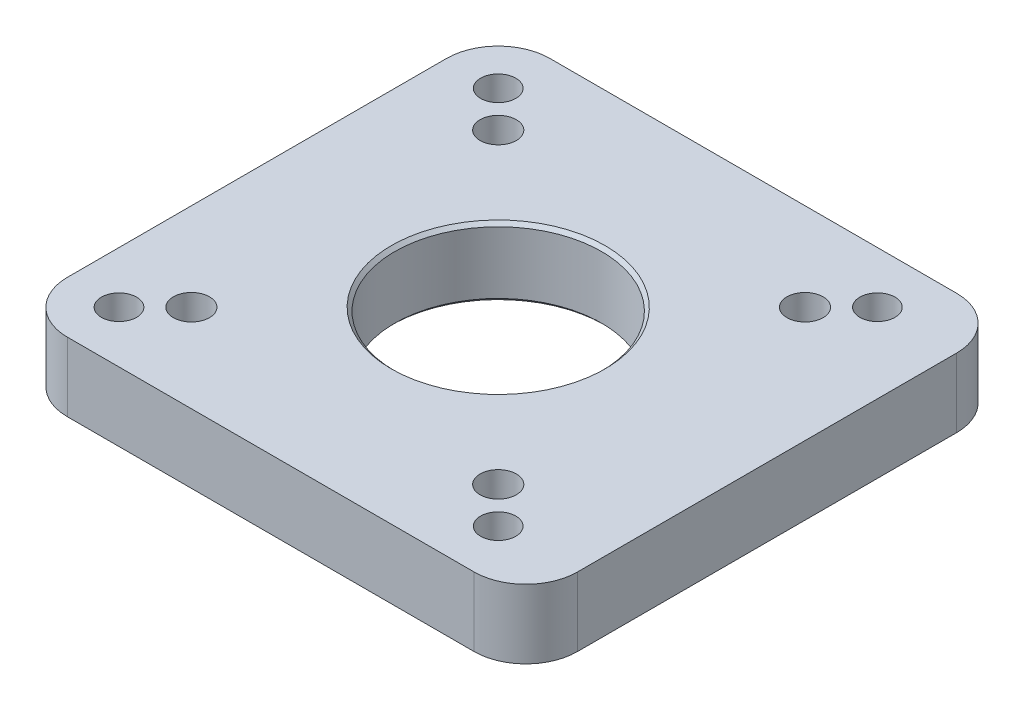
ISO-10303-21;
HEADER;
FILE_DESCRIPTION(('STEP AP214'),'2;1');
FILE_NAME('part.step','',(''),(''),'','','');
FILE_SCHEMA(('AUTOMOTIVE_DESIGN { 1 0 10303 214 1 1 1 1 }'));
ENDSEC;
DATA;
#1=APPLICATION_CONTEXT('core data for automotive mechanical design processes');
#2=APPLICATION_PROTOCOL_DEFINITION('international standard','automotive_design',2000,#1);
#3=PRODUCT_CONTEXT('',#1,'mechanical');
#4=PRODUCT('Part','Part','',(#3));
#5=PRODUCT_RELATED_PRODUCT_CATEGORY('part','',(#4));
#6=PRODUCT_DEFINITION_FORMATION('','',#4);
#7=PRODUCT_DEFINITION_CONTEXT('part definition',#1,'design');
#8=PRODUCT_DEFINITION('design','',#6,#7);
#9=PRODUCT_DEFINITION_SHAPE('','',#8);
#10=(LENGTH_UNIT() NAMED_UNIT(*) SI_UNIT(.MILLI.,.METRE.));
#11=(NAMED_UNIT(*) PLANE_ANGLE_UNIT() SI_UNIT($,.RADIAN.));
#12=(NAMED_UNIT(*) SI_UNIT($,.STERADIAN.) SOLID_ANGLE_UNIT());
#13=UNCERTAINTY_MEASURE_WITH_UNIT(LENGTH_MEASURE(1.E-05),#10,'distance_accuracy_value','');
#14=(GEOMETRIC_REPRESENTATION_CONTEXT(3) GLOBAL_UNCERTAINTY_ASSIGNED_CONTEXT((#13)) GLOBAL_UNIT_ASSIGNED_CONTEXT((#10,
#11,#12)) REPRESENTATION_CONTEXT('',''));
#15=CARTESIAN_POINT('',(0.,0.,0.));
#16=DIRECTION('',(0.,0.,1.));
#17=DIRECTION('',(1.,0.,0.));
#18=AXIS2_PLACEMENT_3D('',#15,#16,#17);
#19=CARTESIAN_POINT('',(-70.,20.,70.));
#20=DIRECTION('',(0.,1.,0.));
#21=DIRECTION('',(0.,0.,1.));
#22=AXIS2_PLACEMENT_3D('',#19,#20,#21);
#23=PLANE('',#22);
#24=CARTESIAN_POINT('',(0.,20.,0.));
#25=DIRECTION('',(0.,1.,0.));
#26=DIRECTION('',(0.,0.,1.));
#27=AXIS2_PLACEMENT_3D('',#24,#25,#26);
#28=CIRCLE('',#27,31.);
#29=CARTESIAN_POINT('',(0.,20.,31.));
#30=VERTEX_POINT('',#29);
#31=EDGE_CURVE('E356',#30,#30,#28,.F.);
#32=ORIENTED_EDGE('',*,*,#31,.T.);
#33=EDGE_LOOP('',(#32));
#34=FACE_BOUND('',#33,.T.);
#35=CARTESIAN_POINT('',(-55.,20.,55.));
#36=DIRECTION('',(0.,1.,0.));
#37=DIRECTION('',(0.,0.,1.));
#38=AXIS2_PLACEMENT_3D('',#35,#36,#37);
#39=CIRCLE('',#38,5.09999999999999);
#40=CARTESIAN_POINT('',(-55.,20.,60.1));
#41=VERTEX_POINT('',#40);
#42=EDGE_CURVE('E491',#41,#41,#39,.T.);
#43=ORIENTED_EDGE('',*,*,#42,.F.);
#44=EDGE_LOOP('',(#43));
#45=FACE_BOUND('',#44,.T.);
#46=CARTESIAN_POINT('',(55.,20.,55.));
#47=DIRECTION('',(0.,1.,0.));
#48=DIRECTION('',(0.,0.,1.));
#49=AXIS2_PLACEMENT_3D('',#46,#47,#48);
#50=CIRCLE('',#49,5.09999999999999);
#51=CARTESIAN_POINT('',(55.,20.,60.1));
#52=VERTEX_POINT('',#51);
#53=EDGE_CURVE('E487',#52,#52,#50,.T.);
#54=ORIENTED_EDGE('',*,*,#53,.F.);
#55=EDGE_LOOP('',(#54));
#56=FACE_BOUND('',#55,.T.);
#57=CARTESIAN_POINT('',(55.,20.,-55.));
#58=DIRECTION('',(0.,1.,0.));
#59=DIRECTION('',(0.,0.,1.));
#60=AXIS2_PLACEMENT_3D('',#57,#58,#59);
#61=CIRCLE('',#60,5.09999999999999);
#62=CARTESIAN_POINT('',(55.,20.,-49.9));
#63=VERTEX_POINT('',#62);
#64=EDGE_CURVE('E483',#63,#63,#61,.T.);
#65=ORIENTED_EDGE('',*,*,#64,.F.);
#66=EDGE_LOOP('',(#65));
#67=FACE_BOUND('',#66,.T.);
#68=CARTESIAN_POINT('',(-55.,20.,-55.));
#69=DIRECTION('',(0.,1.,0.));
#70=DIRECTION('',(0.,0.,1.));
#71=AXIS2_PLACEMENT_3D('',#68,#69,#70);
#72=CIRCLE('',#71,5.09999999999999);
#73=CARTESIAN_POINT('',(-55.,20.,-49.9));
#74=VERTEX_POINT('',#73);
#75=EDGE_CURVE('E478',#74,#74,#72,.T.);
#76=ORIENTED_EDGE('',*,*,#75,.F.);
#77=EDGE_LOOP('',(#76));
#78=FACE_BOUND('',#77,.T.);
#79=CARTESIAN_POINT('',(-44.5,20.,44.5));
#80=DIRECTION('',(0.,1.,0.));
#81=DIRECTION('',(0.,0.,1.));
#82=AXIS2_PLACEMENT_3D('',#79,#80,#81);
#83=CIRCLE('',#82,5.24999999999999);
#84=CARTESIAN_POINT('',(-44.5,20.,49.75));
#85=VERTEX_POINT('',#84);
#86=EDGE_CURVE('E473',#85,#85,#83,.T.);
#87=ORIENTED_EDGE('',*,*,#86,.F.);
#88=EDGE_LOOP('',(#87));
#89=FACE_BOUND('',#88,.T.);
#90=CARTESIAN_POINT('',(-44.5,20.,-44.5));
#91=DIRECTION('',(0.,1.,0.));
#92=DIRECTION('',(0.,0.,1.));
#93=AXIS2_PLACEMENT_3D('',#90,#91,#92);
#94=CIRCLE('',#93,5.24999999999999);
#95=CARTESIAN_POINT('',(-44.5,20.,-39.25));
#96=VERTEX_POINT('',#95);
#97=EDGE_CURVE('E468',#96,#96,#94,.T.);
#98=ORIENTED_EDGE('',*,*,#97,.F.);
#99=EDGE_LOOP('',(#98));
#100=FACE_BOUND('',#99,.T.);
#101=CARTESIAN_POINT('',(44.5,20.,-44.5));
#102=DIRECTION('',(0.,1.,0.));
#103=DIRECTION('',(0.,0.,1.));
#104=AXIS2_PLACEMENT_3D('',#101,#102,#103);
#105=CIRCLE('',#104,5.24999999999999);
#106=CARTESIAN_POINT('',(44.5,20.,-39.25));
#107=VERTEX_POINT('',#106);
#108=EDGE_CURVE('E463',#107,#107,#105,.T.);
#109=ORIENTED_EDGE('',*,*,#108,.F.);
#110=EDGE_LOOP('',(#109));
#111=FACE_BOUND('',#110,.T.);
#112=CARTESIAN_POINT('',(44.5,20.,44.5));
#113=DIRECTION('',(0.,1.,0.));
#114=DIRECTION('',(0.,0.,1.));
#115=AXIS2_PLACEMENT_3D('',#112,#113,#114);
#116=CIRCLE('',#115,5.24999999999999);
#117=CARTESIAN_POINT('',(44.5,20.,49.75));
#118=VERTEX_POINT('',#117);
#119=EDGE_CURVE('E447',#118,#118,#116,.T.);
#120=ORIENTED_EDGE('',*,*,#119,.F.);
#121=EDGE_LOOP('',(#120));
#122=FACE_BOUND('',#121,.T.);
#123=DIRECTION('',(0.,0.,1.));
#124=VECTOR('',#123,1.);
#125=CARTESIAN_POINT('',(-70.,20.,-70.));
#126=LINE('',#125,#124);
#127=CARTESIAN_POINT('',(-70.,20.,-55.));
#128=VERTEX_POINT('',#127);
#129=CARTESIAN_POINT('',(-70.,20.,55.));
#130=VERTEX_POINT('',#129);
#131=EDGE_CURVE('E452',#128,#130,#126,.T.);
#132=ORIENTED_EDGE('',*,*,#131,.T.);
#133=CARTESIAN_POINT('',(-55.,20.,55.));
#134=DIRECTION('',(0.,1.,0.));
#135=DIRECTION('',(0.,0.,1.));
#136=AXIS2_PLACEMENT_3D('',#133,#134,#135);
#137=CIRCLE('',#136,15.);
#138=CARTESIAN_POINT('',(-55.,20.,70.));
#139=VERTEX_POINT('',#138);
#140=EDGE_CURVE('E508',#130,#139,#137,.T.);
#141=ORIENTED_EDGE('',*,*,#140,.T.);
#142=DIRECTION('',(1.,0.,0.));
#143=VECTOR('',#142,1.);
#144=CARTESIAN_POINT('',(-70.,20.,70.));
#145=LINE('',#144,#143);
#146=CARTESIAN_POINT('',(63.,20.,70.));
#147=VERTEX_POINT('',#146);
#148=EDGE_CURVE('E435',#139,#147,#145,.T.);
#149=ORIENTED_EDGE('',*,*,#148,.T.);
#150=CARTESIAN_POINT('',(63.,20.,55.));
#151=DIRECTION('',(0.,1.,0.));
#152=DIRECTION('',(0.,0.,1.));
#153=AXIS2_PLACEMENT_3D('',#150,#151,#152);
#154=CIRCLE('',#153,15.);
#155=CARTESIAN_POINT('',(78.,20.,55.));
#156=VERTEX_POINT('',#155);
#157=EDGE_CURVE('E506',#147,#156,#154,.T.);
#158=ORIENTED_EDGE('',*,*,#157,.T.);
#159=DIRECTION('',(0.,0.,-1.));
#160=VECTOR('',#159,1.);
#161=CARTESIAN_POINT('',(78.,20.,-70.));
#162=LINE('',#161,#160);
#163=CARTESIAN_POINT('',(78.,20.,-55.));
#164=VERTEX_POINT('',#163);
#165=EDGE_CURVE('E456',#156,#164,#162,.T.);
#166=ORIENTED_EDGE('',*,*,#165,.T.);
#167=CARTESIAN_POINT('',(63.,20.,-55.));
#168=DIRECTION('',(0.,1.,0.));
#169=DIRECTION('',(0.,0.,1.));
#170=AXIS2_PLACEMENT_3D('',#167,#168,#169);
#171=CIRCLE('',#170,15.);
#172=CARTESIAN_POINT('',(63.,20.,-70.));
#173=VERTEX_POINT('',#172);
#174=EDGE_CURVE('E370',#164,#173,#171,.T.);
#175=ORIENTED_EDGE('',*,*,#174,.T.);
#176=DIRECTION('',(-1.,0.,0.));
#177=VECTOR('',#176,1.);
#178=CARTESIAN_POINT('',(-70.,20.,-70.));
#179=LINE('',#178,#177);
#180=CARTESIAN_POINT('',(-55.,20.,-70.));
#181=VERTEX_POINT('',#180);
#182=EDGE_CURVE('E458',#173,#181,#179,.T.);
#183=ORIENTED_EDGE('',*,*,#182,.T.);
#184=CARTESIAN_POINT('',(-55.,20.,-55.));
#185=DIRECTION('',(0.,1.,0.));
#186=DIRECTION('',(0.,0.,1.));
#187=AXIS2_PLACEMENT_3D('',#184,#185,#186);
#188=CIRCLE('',#187,15.);
#189=EDGE_CURVE('E503',#181,#128,#188,.T.);
#190=ORIENTED_EDGE('',*,*,#189,.T.);
#191=EDGE_LOOP('',(#132,#141,#149,#158,#166,#175,#183,#190));
#192=FACE_BOUND('',#191,.T.);
#193=ADVANCED_FACE('F348',(#34,#45,#56,#67,#78,#89,#100,#111,#122,#192),#23,.T.);
#194=CARTESIAN_POINT('',(-70.,0.,70.));
#195=DIRECTION('',(0.,1.,0.));
#196=DIRECTION('',(0.,0.,1.));
#197=AXIS2_PLACEMENT_3D('',#194,#195,#196);
#198=PLANE('',#197);
#199=CARTESIAN_POINT('',(0.,0.,0.));
#200=DIRECTION('',(0.,1.,0.));
#201=DIRECTION('',(0.,0.,1.));
#202=AXIS2_PLACEMENT_3D('',#199,#200,#201);
#203=CIRCLE('',#202,31.);
#204=CARTESIAN_POINT('',(0.,0.,31.));
#205=VERTEX_POINT('',#204);
#206=EDGE_CURVE('E11',#205,#205,#203,.T.);
#207=ORIENTED_EDGE('',*,*,#206,.T.);
#208=EDGE_LOOP('',(#207));
#209=FACE_BOUND('',#208,.T.);
#210=CARTESIAN_POINT('',(-55.,0.,55.));
#211=DIRECTION('',(0.,-1.,0.));
#212=DIRECTION('',(0.,0.,-1.));
#213=AXIS2_PLACEMENT_3D('',#210,#211,#212);
#214=CIRCLE('',#213,5.09999999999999);
#215=CARTESIAN_POINT('',(-55.,0.,49.9));
#216=VERTEX_POINT('',#215);
#217=EDGE_CURVE('E494',#216,#216,#214,.T.);
#218=ORIENTED_EDGE('',*,*,#217,.F.);
#219=EDGE_LOOP('',(#218));
#220=FACE_BOUND('',#219,.T.);
#221=CARTESIAN_POINT('',(55.,0.,55.));
#222=DIRECTION('',(0.,-1.,0.));
#223=DIRECTION('',(0.,0.,-1.));
#224=AXIS2_PLACEMENT_3D('',#221,#222,#223);
#225=CIRCLE('',#224,5.09999999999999);
#226=CARTESIAN_POINT('',(55.,0.,49.9));
#227=VERTEX_POINT('',#226);
#228=EDGE_CURVE('E490',#227,#227,#225,.T.);
#229=ORIENTED_EDGE('',*,*,#228,.F.);
#230=EDGE_LOOP('',(#229));
#231=FACE_BOUND('',#230,.T.);
#232=CARTESIAN_POINT('',(55.,0.,-55.));
#233=DIRECTION('',(0.,-1.,0.));
#234=DIRECTION('',(0.,0.,-1.));
#235=AXIS2_PLACEMENT_3D('',#232,#233,#234);
#236=CIRCLE('',#235,5.09999999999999);
#237=CARTESIAN_POINT('',(55.,0.,-60.1));
#238=VERTEX_POINT('',#237);
#239=EDGE_CURVE('E486',#238,#238,#236,.T.);
#240=ORIENTED_EDGE('',*,*,#239,.F.);
#241=EDGE_LOOP('',(#240));
#242=FACE_BOUND('',#241,.T.);
#243=CARTESIAN_POINT('',(-55.,0.,-55.));
#244=DIRECTION('',(0.,-1.,0.));
#245=DIRECTION('',(0.,0.,-1.));
#246=AXIS2_PLACEMENT_3D('',#243,#244,#245);
#247=CIRCLE('',#246,5.09999999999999);
#248=CARTESIAN_POINT('',(-55.,0.,-60.1));
#249=VERTEX_POINT('',#248);
#250=EDGE_CURVE('E482',#249,#249,#247,.T.);
#251=ORIENTED_EDGE('',*,*,#250,.F.);
#252=EDGE_LOOP('',(#251));
#253=FACE_BOUND('',#252,.T.);
#254=CARTESIAN_POINT('',(-44.5,0.,44.5));
#255=DIRECTION('',(0.,-1.,0.));
#256=DIRECTION('',(0.,0.,-1.));
#257=AXIS2_PLACEMENT_3D('',#254,#255,#256);
#258=CIRCLE('',#257,9.);
#259=CARTESIAN_POINT('',(-44.5,0.,35.5));
#260=VERTEX_POINT('',#259);
#261=EDGE_CURVE('E477',#260,#260,#258,.T.);
#262=ORIENTED_EDGE('',*,*,#261,.F.);
#263=EDGE_LOOP('',(#262));
#264=FACE_BOUND('',#263,.T.);
#265=CARTESIAN_POINT('',(-44.5,0.,-44.5));
#266=DIRECTION('',(0.,-1.,0.));
#267=DIRECTION('',(0.,0.,-1.));
#268=AXIS2_PLACEMENT_3D('',#265,#266,#267);
#269=CIRCLE('',#268,9.);
#270=CARTESIAN_POINT('',(-44.5,0.,-53.5));
#271=VERTEX_POINT('',#270);
#272=EDGE_CURVE('E472',#271,#271,#269,.T.);
#273=ORIENTED_EDGE('',*,*,#272,.F.);
#274=EDGE_LOOP('',(#273));
#275=FACE_BOUND('',#274,.T.);
#276=CARTESIAN_POINT('',(44.5,0.,-44.5));
#277=DIRECTION('',(0.,-1.,0.));
#278=DIRECTION('',(0.,0.,-1.));
#279=AXIS2_PLACEMENT_3D('',#276,#277,#278);
#280=CIRCLE('',#279,9.);
#281=CARTESIAN_POINT('',(44.5,0.,-53.5));
#282=VERTEX_POINT('',#281);
#283=EDGE_CURVE('E467',#282,#282,#280,.T.);
#284=ORIENTED_EDGE('',*,*,#283,.F.);
#285=EDGE_LOOP('',(#284));
#286=FACE_BOUND('',#285,.T.);
#287=CARTESIAN_POINT('',(44.5,0.,44.5));
#288=DIRECTION('',(0.,-1.,0.));
#289=DIRECTION('',(0.,0.,-1.));
#290=AXIS2_PLACEMENT_3D('',#287,#288,#289);
#291=CIRCLE('',#290,9.);
#292=CARTESIAN_POINT('',(44.5,0.,35.5));
#293=VERTEX_POINT('',#292);
#294=EDGE_CURVE('E462',#293,#293,#291,.T.);
#295=ORIENTED_EDGE('',*,*,#294,.F.);
#296=EDGE_LOOP('',(#295));
#297=FACE_BOUND('',#296,.T.);
#298=DIRECTION('',(1.,0.,0.));
#299=VECTOR('',#298,1.);
#300=CARTESIAN_POINT('',(-70.,0.,70.));
#301=LINE('',#300,#299);
#302=CARTESIAN_POINT('',(-55.,0.,70.));
#303=VERTEX_POINT('',#302);
#304=CARTESIAN_POINT('',(63.,0.,70.));
#305=VERTEX_POINT('',#304);
#306=EDGE_CURVE('E432',#303,#305,#301,.T.);
#307=ORIENTED_EDGE('',*,*,#306,.F.);
#308=CARTESIAN_POINT('',(-55.,0.,55.));
#309=DIRECTION('',(0.,1.,0.));
#310=DIRECTION('',(0.,0.,1.));
#311=AXIS2_PLACEMENT_3D('',#308,#309,#310);
#312=CIRCLE('',#311,15.);
#313=CARTESIAN_POINT('',(-70.,0.,55.));
#314=VERTEX_POINT('',#313);
#315=EDGE_CURVE('E415',#303,#314,#312,.F.);
#316=ORIENTED_EDGE('',*,*,#315,.T.);
#317=DIRECTION('',(0.,0.,1.));
#318=VECTOR('',#317,1.);
#319=CARTESIAN_POINT('',(-70.,0.,-70.));
#320=LINE('',#319,#318);
#321=CARTESIAN_POINT('',(-70.,0.,-55.));
#322=VERTEX_POINT('',#321);
#323=EDGE_CURVE('E442',#322,#314,#320,.T.);
#324=ORIENTED_EDGE('',*,*,#323,.F.);
#325=CARTESIAN_POINT('',(-55.,0.,-55.));
#326=DIRECTION('',(0.,1.,0.));
#327=DIRECTION('',(0.,0.,1.));
#328=AXIS2_PLACEMENT_3D('',#325,#326,#327);
#329=CIRCLE('',#328,15.);
#330=CARTESIAN_POINT('',(-55.,0.,-70.));
#331=VERTEX_POINT('',#330);
#332=EDGE_CURVE('E436',#322,#331,#329,.F.);
#333=ORIENTED_EDGE('',*,*,#332,.T.);
#334=DIRECTION('',(-1.,0.,0.));
#335=VECTOR('',#334,1.);
#336=CARTESIAN_POINT('',(-70.,0.,-70.));
#337=LINE('',#336,#335);
#338=CARTESIAN_POINT('',(63.,0.,-70.));
#339=VERTEX_POINT('',#338);
#340=EDGE_CURVE('E445',#339,#331,#337,.T.);
#341=ORIENTED_EDGE('',*,*,#340,.F.);
#342=CARTESIAN_POINT('',(63.,0.,-55.));
#343=DIRECTION('',(0.,1.,0.));
#344=DIRECTION('',(0.,0.,1.));
#345=AXIS2_PLACEMENT_3D('',#342,#343,#344);
#346=CIRCLE('',#345,15.);
#347=CARTESIAN_POINT('',(78.,0.,-55.));
#348=VERTEX_POINT('',#347);
#349=EDGE_CURVE('E497',#339,#348,#346,.F.);
#350=ORIENTED_EDGE('',*,*,#349,.T.);
#351=DIRECTION('',(0.,0.,-1.));
#352=VECTOR('',#351,1.);
#353=CARTESIAN_POINT('',(78.,0.,-70.));
#354=LINE('',#353,#352);
#355=CARTESIAN_POINT('',(78.,0.,55.));
#356=VERTEX_POINT('',#355);
#357=EDGE_CURVE('E441',#356,#348,#354,.T.);
#358=ORIENTED_EDGE('',*,*,#357,.F.);
#359=CARTESIAN_POINT('',(63.,0.,55.));
#360=DIRECTION('',(0.,1.,0.));
#361=DIRECTION('',(0.,0.,1.));
#362=AXIS2_PLACEMENT_3D('',#359,#360,#361);
#363=CIRCLE('',#362,15.);
#364=EDGE_CURVE('E426',#356,#305,#363,.F.);
#365=ORIENTED_EDGE('',*,*,#364,.T.);
#366=EDGE_LOOP('',(#307,#316,#324,#333,#341,#350,#358,#365));
#367=FACE_BOUND('',#366,.T.);
#368=ADVANCED_FACE('F439',(#209,#220,#231,#242,#253,#264,#275,#286,#297,#367),#198,.F.);
#369=CARTESIAN_POINT('',(-70.,20.,-70.));
#370=DIRECTION('',(1.,0.,0.));
#371=DIRECTION('',(0.,0.,-1.));
#372=AXIS2_PLACEMENT_3D('',#369,#370,#371);
#373=PLANE('',#372);
#374=ORIENTED_EDGE('',*,*,#323,.T.);
#375=DIRECTION('',(0.,-1.,0.));
#376=VECTOR('',#375,1.);
#377=CARTESIAN_POINT('',(-70.,20.,55.));
#378=LINE('',#377,#376);
#379=EDGE_CURVE('E420',#314,#130,#378,.F.);
#380=ORIENTED_EDGE('',*,*,#379,.T.);
#381=ORIENTED_EDGE('',*,*,#131,.F.);
#382=DIRECTION('',(0.,-1.,0.));
#383=VECTOR('',#382,1.);
#384=CARTESIAN_POINT('',(-70.,20.,-55.));
#385=LINE('',#384,#383);
#386=EDGE_CURVE('E425',#128,#322,#385,.T.);
#387=ORIENTED_EDGE('',*,*,#386,.T.);
#388=EDGE_LOOP('',(#374,#380,#381,#387));
#389=FACE_BOUND('',#388,.T.);
#390=ADVANCED_FACE('F350',(#389),#373,.F.);
#391=CARTESIAN_POINT('',(-70.,20.,70.));
#392=DIRECTION('',(0.,0.,-1.));
#393=DIRECTION('',(-1.,0.,0.));
#394=AXIS2_PLACEMENT_3D('',#391,#392,#393);
#395=PLANE('',#394);
#396=ORIENTED_EDGE('',*,*,#148,.F.);
#397=DIRECTION('',(0.,-1.,0.));
#398=VECTOR('',#397,1.);
#399=CARTESIAN_POINT('',(-55.,20.,70.));
#400=LINE('',#399,#398);
#401=EDGE_CURVE('E419',#139,#303,#400,.T.);
#402=ORIENTED_EDGE('',*,*,#401,.T.);
#403=ORIENTED_EDGE('',*,*,#306,.T.);
#404=DIRECTION('',(0.,-1.,0.));
#405=VECTOR('',#404,1.);
#406=CARTESIAN_POINT('',(63.,20.,70.));
#407=LINE('',#406,#405);
#408=EDGE_CURVE('E437',#305,#147,#407,.F.);
#409=ORIENTED_EDGE('',*,*,#408,.T.);
#410=EDGE_LOOP('',(#396,#402,#403,#409));
#411=FACE_BOUND('',#410,.T.);
#412=ADVANCED_FACE('F431',(#411),#395,.F.);
#413=CARTESIAN_POINT('',(78.,20.,-70.));
#414=DIRECTION('',(-1.,0.,0.));
#415=DIRECTION('',(0.,0.,1.));
#416=AXIS2_PLACEMENT_3D('',#413,#414,#415);
#417=PLANE('',#416);
#418=ORIENTED_EDGE('',*,*,#165,.F.);
#419=DIRECTION('',(0.,-1.,0.));
#420=VECTOR('',#419,1.);
#421=CARTESIAN_POINT('',(78.,20.,55.));
#422=LINE('',#421,#420);
#423=EDGE_CURVE('E512',#156,#356,#422,.T.);
#424=ORIENTED_EDGE('',*,*,#423,.T.);
#425=ORIENTED_EDGE('',*,*,#357,.T.);
#426=DIRECTION('',(0.,-1.,0.));
#427=VECTOR('',#426,1.);
#428=CARTESIAN_POINT('',(78.,20.,-55.));
#429=LINE('',#428,#427);
#430=EDGE_CURVE('E510',#348,#164,#429,.F.);
#431=ORIENTED_EDGE('',*,*,#430,.T.);
#432=EDGE_LOOP('',(#418,#424,#425,#431));
#433=FACE_BOUND('',#432,.T.);
#434=ADVANCED_FACE('F626',(#433),#417,.F.);
#435=CARTESIAN_POINT('',(-70.,20.,-70.));
#436=DIRECTION('',(0.,0.,1.));
#437=DIRECTION('',(1.,0.,0.));
#438=AXIS2_PLACEMENT_3D('',#435,#436,#437);
#439=PLANE('',#438);
#440=ORIENTED_EDGE('',*,*,#182,.F.);
#441=DIRECTION('',(0.,-1.,0.));
#442=VECTOR('',#441,1.);
#443=CARTESIAN_POINT('',(63.,20.,-70.));
#444=LINE('',#443,#442);
#445=EDGE_CURVE('E516',#173,#339,#444,.T.);
#446=ORIENTED_EDGE('',*,*,#445,.T.);
#447=ORIENTED_EDGE('',*,*,#340,.T.);
#448=DIRECTION('',(0.,-1.,0.));
#449=VECTOR('',#448,1.);
#450=CARTESIAN_POINT('',(-55.,20.,-70.));
#451=LINE('',#450,#449);
#452=EDGE_CURVE('E363',#331,#181,#451,.F.);
#453=ORIENTED_EDGE('',*,*,#452,.T.);
#454=EDGE_LOOP('',(#440,#446,#447,#453));
#455=FACE_BOUND('',#454,.T.);
#456=ADVANCED_FACE('F541',(#455),#439,.F.);
#457=CARTESIAN_POINT('',(0.,20.,0.));
#458=DIRECTION('',(0.,-1.,0.));
#459=DIRECTION('',(0.,0.,-1.));
#460=AXIS2_PLACEMENT_3D('',#457,#458,#459);
#461=CYLINDRICAL_SURFACE('',#460,30.);
#462=CARTESIAN_POINT('',(0.,19.,0.));
#463=DIRECTION('',(0.,1.,0.));
#464=DIRECTION('',(0.,0.,1.));
#465=AXIS2_PLACEMENT_3D('',#462,#463,#464);
#466=CIRCLE('',#465,30.);
#467=CARTESIAN_POINT('',(0.,19.,30.));
#468=VERTEX_POINT('',#467);
#469=EDGE_CURVE('E522',#468,#468,#466,.T.);
#470=ORIENTED_EDGE('',*,*,#469,.T.);
#471=EDGE_LOOP('',(#470));
#472=FACE_BOUND('',#471,.T.);
#473=CARTESIAN_POINT('',(0.,1.,0.));
#474=DIRECTION('',(0.,1.,0.));
#475=DIRECTION('',(0.,0.,1.));
#476=AXIS2_PLACEMENT_3D('',#473,#474,#475);
#477=CIRCLE('',#476,30.);
#478=CARTESIAN_POINT('',(0.,1.,30.));
#479=VERTEX_POINT('',#478);
#480=EDGE_CURVE('E519',#479,#479,#477,.F.);
#481=ORIENTED_EDGE('',*,*,#480,.T.);
#482=EDGE_LOOP('',(#481));
#483=FACE_BOUND('',#482,.T.);
#484=ADVANCED_FACE('F537',(#472,#483),#461,.F.);
#485=CARTESIAN_POINT('',(44.5,0.,44.5));
#486=DIRECTION('',(0.,-1.,0.));
#487=DIRECTION('',(0.,0.,-1.));
#488=AXIS2_PLACEMENT_3D('',#485,#486,#487);
#489=CYLINDRICAL_SURFACE('',#488,9.);
#490=CARTESIAN_POINT('',(44.5,11.,44.5));
#491=DIRECTION('',(0.,-1.,0.));
#492=DIRECTION('',(0.,0.,-1.));
#493=AXIS2_PLACEMENT_3D('',#490,#491,#492);
#494=CIRCLE('',#493,8.99999999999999);
#495=CARTESIAN_POINT('',(44.5,11.,35.5));
#496=VERTEX_POINT('',#495);
#497=EDGE_CURVE('E577',#496,#496,#494,.T.);
#498=ORIENTED_EDGE('',*,*,#497,.F.);
#499=EDGE_LOOP('',(#498));
#500=FACE_BOUND('',#499,.T.);
#501=ORIENTED_EDGE('',*,*,#294,.T.);
#502=EDGE_LOOP('',(#501));
#503=FACE_BOUND('',#502,.T.);
#504=ADVANCED_FACE('F540',(#500,#503),#489,.F.);
#505=CARTESIAN_POINT('',(49.75,11.,44.5));
#506=DIRECTION('',(0.,1.,0.));
#507=DIRECTION('',(0.,0.,1.));
#508=AXIS2_PLACEMENT_3D('',#505,#506,#507);
#509=PLANE('',#508);
#510=CARTESIAN_POINT('',(44.5,11.,44.5));
#511=DIRECTION('',(0.,-1.,0.));
#512=DIRECTION('',(0.,0.,-1.));
#513=AXIS2_PLACEMENT_3D('',#510,#511,#512);
#514=CIRCLE('',#513,5.25);
#515=CARTESIAN_POINT('',(44.5,11.,39.25));
#516=VERTEX_POINT('',#515);
#517=EDGE_CURVE('E466',#516,#516,#514,.T.);
#518=ORIENTED_EDGE('',*,*,#517,.F.);
#519=EDGE_LOOP('',(#518));
#520=FACE_BOUND('',#519,.T.);
#521=ORIENTED_EDGE('',*,*,#497,.T.);
#522=EDGE_LOOP('',(#521));
#523=FACE_BOUND('',#522,.T.);
#524=ADVANCED_FACE('F778',(#520,#523),#509,.F.);
#525=CARTESIAN_POINT('',(44.5,0.,44.5));
#526=DIRECTION('',(0.,-1.,0.));
#527=DIRECTION('',(0.,0.,-1.));
#528=AXIS2_PLACEMENT_3D('',#525,#526,#527);
#529=CYLINDRICAL_SURFACE('',#528,5.24999999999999);
#530=ORIENTED_EDGE('',*,*,#119,.T.);
#531=EDGE_LOOP('',(#530));
#532=FACE_BOUND('',#531,.T.);
#533=ORIENTED_EDGE('',*,*,#517,.T.);
#534=EDGE_LOOP('',(#533));
#535=FACE_BOUND('',#534,.T.);
#536=ADVANCED_FACE('F770',(#532,#535),#529,.F.);
#537=CARTESIAN_POINT('',(44.5,0.,-44.5));
#538=DIRECTION('',(0.,-1.,0.));
#539=DIRECTION('',(0.,0.,-1.));
#540=AXIS2_PLACEMENT_3D('',#537,#538,#539);
#541=CYLINDRICAL_SURFACE('',#540,9.);
#542=CARTESIAN_POINT('',(44.5,11.,-44.5));
#543=DIRECTION('',(0.,-1.,0.));
#544=DIRECTION('',(0.,0.,-1.));
#545=AXIS2_PLACEMENT_3D('',#542,#543,#544);
#546=CIRCLE('',#545,8.99999999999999);
#547=CARTESIAN_POINT('',(44.5,11.,-53.5));
#548=VERTEX_POINT('',#547);
#549=EDGE_CURVE('E584',#548,#548,#546,.T.);
#550=ORIENTED_EDGE('',*,*,#549,.F.);
#551=EDGE_LOOP('',(#550));
#552=FACE_BOUND('',#551,.T.);
#553=ORIENTED_EDGE('',*,*,#283,.T.);
#554=EDGE_LOOP('',(#553));
#555=FACE_BOUND('',#554,.T.);
#556=ADVANCED_FACE('F762',(#552,#555),#541,.F.);
#557=CARTESIAN_POINT('',(49.75,11.,-44.5));
#558=DIRECTION('',(0.,1.,0.));
#559=DIRECTION('',(0.,0.,1.));
#560=AXIS2_PLACEMENT_3D('',#557,#558,#559);
#561=PLANE('',#560);
#562=CARTESIAN_POINT('',(44.5,11.,-44.5));
#563=DIRECTION('',(0.,-1.,0.));
#564=DIRECTION('',(0.,0.,-1.));
#565=AXIS2_PLACEMENT_3D('',#562,#563,#564);
#566=CIRCLE('',#565,5.25);
#567=CARTESIAN_POINT('',(44.5,11.,-49.75));
#568=VERTEX_POINT('',#567);
#569=EDGE_CURVE('E471',#568,#568,#566,.T.);
#570=ORIENTED_EDGE('',*,*,#569,.F.);
#571=EDGE_LOOP('',(#570));
#572=FACE_BOUND('',#571,.T.);
#573=ORIENTED_EDGE('',*,*,#549,.T.);
#574=EDGE_LOOP('',(#573));
#575=FACE_BOUND('',#574,.T.);
#576=ADVANCED_FACE('F754',(#572,#575),#561,.F.);
#577=CARTESIAN_POINT('',(44.5,0.,-44.5));
#578=DIRECTION('',(0.,-1.,0.));
#579=DIRECTION('',(0.,0.,-1.));
#580=AXIS2_PLACEMENT_3D('',#577,#578,#579);
#581=CYLINDRICAL_SURFACE('',#580,5.24999999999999);
#582=ORIENTED_EDGE('',*,*,#108,.T.);
#583=EDGE_LOOP('',(#582));
#584=FACE_BOUND('',#583,.T.);
#585=ORIENTED_EDGE('',*,*,#569,.T.);
#586=EDGE_LOOP('',(#585));
#587=FACE_BOUND('',#586,.T.);
#588=ADVANCED_FACE('F746',(#584,#587),#581,.F.);
#589=CARTESIAN_POINT('',(-44.5,0.,-44.5));
#590=DIRECTION('',(0.,-1.,0.));
#591=DIRECTION('',(0.,0.,-1.));
#592=AXIS2_PLACEMENT_3D('',#589,#590,#591);
#593=CYLINDRICAL_SURFACE('',#592,9.);
#594=CARTESIAN_POINT('',(-44.5,11.,-44.5));
#595=DIRECTION('',(0.,-1.,0.));
#596=DIRECTION('',(0.,0.,-1.));
#597=AXIS2_PLACEMENT_3D('',#594,#595,#596);
#598=CIRCLE('',#597,8.99999999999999);
#599=CARTESIAN_POINT('',(-44.5,11.,-53.5));
#600=VERTEX_POINT('',#599);
#601=EDGE_CURVE('E590',#600,#600,#598,.T.);
#602=ORIENTED_EDGE('',*,*,#601,.F.);
#603=EDGE_LOOP('',(#602));
#604=FACE_BOUND('',#603,.T.);
#605=ORIENTED_EDGE('',*,*,#272,.T.);
#606=EDGE_LOOP('',(#605));
#607=FACE_BOUND('',#606,.T.);
#608=ADVANCED_FACE('F738',(#604,#607),#593,.F.);
#609=CARTESIAN_POINT('',(-39.25,11.,-44.5));
#610=DIRECTION('',(0.,1.,0.));
#611=DIRECTION('',(0.,0.,1.));
#612=AXIS2_PLACEMENT_3D('',#609,#610,#611);
#613=PLANE('',#612);
#614=CARTESIAN_POINT('',(-44.5,11.,-44.5));
#615=DIRECTION('',(0.,-1.,0.));
#616=DIRECTION('',(0.,0.,-1.));
#617=AXIS2_PLACEMENT_3D('',#614,#615,#616);
#618=CIRCLE('',#617,5.25);
#619=CARTESIAN_POINT('',(-44.5,11.,-49.75));
#620=VERTEX_POINT('',#619);
#621=EDGE_CURVE('E476',#620,#620,#618,.T.);
#622=ORIENTED_EDGE('',*,*,#621,.F.);
#623=EDGE_LOOP('',(#622));
#624=FACE_BOUND('',#623,.T.);
#625=ORIENTED_EDGE('',*,*,#601,.T.);
#626=EDGE_LOOP('',(#625));
#627=FACE_BOUND('',#626,.T.);
#628=ADVANCED_FACE('F730',(#624,#627),#613,.F.);
#629=CARTESIAN_POINT('',(-44.5,0.,-44.5));
#630=DIRECTION('',(0.,-1.,0.));
#631=DIRECTION('',(0.,0.,-1.));
#632=AXIS2_PLACEMENT_3D('',#629,#630,#631);
#633=CYLINDRICAL_SURFACE('',#632,5.24999999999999);
#634=ORIENTED_EDGE('',*,*,#97,.T.);
#635=EDGE_LOOP('',(#634));
#636=FACE_BOUND('',#635,.T.);
#637=ORIENTED_EDGE('',*,*,#621,.T.);
#638=EDGE_LOOP('',(#637));
#639=FACE_BOUND('',#638,.T.);
#640=ADVANCED_FACE('F722',(#636,#639),#633,.F.);
#641=CARTESIAN_POINT('',(-44.5,0.,44.5));
#642=DIRECTION('',(0.,-1.,0.));
#643=DIRECTION('',(0.,0.,-1.));
#644=AXIS2_PLACEMENT_3D('',#641,#642,#643);
#645=CYLINDRICAL_SURFACE('',#644,9.);
#646=CARTESIAN_POINT('',(-44.5,11.,44.5));
#647=DIRECTION('',(0.,-1.,0.));
#648=DIRECTION('',(0.,0.,-1.));
#649=AXIS2_PLACEMENT_3D('',#646,#647,#648);
#650=CIRCLE('',#649,8.99999999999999);
#651=CARTESIAN_POINT('',(-44.5,11.,35.5));
#652=VERTEX_POINT('',#651);
#653=EDGE_CURVE('E596',#652,#652,#650,.T.);
#654=ORIENTED_EDGE('',*,*,#653,.F.);
#655=EDGE_LOOP('',(#654));
#656=FACE_BOUND('',#655,.T.);
#657=ORIENTED_EDGE('',*,*,#261,.T.);
#658=EDGE_LOOP('',(#657));
#659=FACE_BOUND('',#658,.T.);
#660=ADVANCED_FACE('F714',(#656,#659),#645,.F.);
#661=CARTESIAN_POINT('',(-39.25,11.,44.5));
#662=DIRECTION('',(0.,1.,0.));
#663=DIRECTION('',(0.,0.,1.));
#664=AXIS2_PLACEMENT_3D('',#661,#662,#663);
#665=PLANE('',#664);
#666=CARTESIAN_POINT('',(-44.5,11.,44.5));
#667=DIRECTION('',(0.,-1.,0.));
#668=DIRECTION('',(0.,0.,-1.));
#669=AXIS2_PLACEMENT_3D('',#666,#667,#668);
#670=CIRCLE('',#669,5.25);
#671=CARTESIAN_POINT('',(-44.5,11.,39.25));
#672=VERTEX_POINT('',#671);
#673=EDGE_CURVE('E481',#672,#672,#670,.T.);
#674=ORIENTED_EDGE('',*,*,#673,.F.);
#675=EDGE_LOOP('',(#674));
#676=FACE_BOUND('',#675,.T.);
#677=ORIENTED_EDGE('',*,*,#653,.T.);
#678=EDGE_LOOP('',(#677));
#679=FACE_BOUND('',#678,.T.);
#680=ADVANCED_FACE('F706',(#676,#679),#665,.F.);
#681=CARTESIAN_POINT('',(-44.5,0.,44.5));
#682=DIRECTION('',(0.,-1.,0.));
#683=DIRECTION('',(0.,0.,-1.));
#684=AXIS2_PLACEMENT_3D('',#681,#682,#683);
#685=CYLINDRICAL_SURFACE('',#684,5.24999999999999);
#686=ORIENTED_EDGE('',*,*,#86,.T.);
#687=EDGE_LOOP('',(#686));
#688=FACE_BOUND('',#687,.T.);
#689=ORIENTED_EDGE('',*,*,#673,.T.);
#690=EDGE_LOOP('',(#689));
#691=FACE_BOUND('',#690,.T.);
#692=ADVANCED_FACE('F698',(#688,#691),#685,.F.);
#693=CARTESIAN_POINT('',(-55.,0.,-55.));
#694=DIRECTION('',(0.,-1.,0.));
#695=DIRECTION('',(0.,0.,-1.));
#696=AXIS2_PLACEMENT_3D('',#693,#694,#695);
#697=CYLINDRICAL_SURFACE('',#696,5.09999999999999);
#698=ORIENTED_EDGE('',*,*,#75,.T.);
#699=EDGE_LOOP('',(#698));
#700=FACE_BOUND('',#699,.T.);
#701=ORIENTED_EDGE('',*,*,#250,.T.);
#702=EDGE_LOOP('',(#701));
#703=FACE_BOUND('',#702,.T.);
#704=ADVANCED_FACE('F690',(#700,#703),#697,.F.);
#705=CARTESIAN_POINT('',(55.,0.,-55.));
#706=DIRECTION('',(0.,-1.,0.));
#707=DIRECTION('',(0.,0.,-1.));
#708=AXIS2_PLACEMENT_3D('',#705,#706,#707);
#709=CYLINDRICAL_SURFACE('',#708,5.09999999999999);
#710=ORIENTED_EDGE('',*,*,#64,.T.);
#711=EDGE_LOOP('',(#710));
#712=FACE_BOUND('',#711,.T.);
#713=ORIENTED_EDGE('',*,*,#239,.T.);
#714=EDGE_LOOP('',(#713));
#715=FACE_BOUND('',#714,.T.);
#716=ADVANCED_FACE('F616',(#712,#715),#709,.F.);
#717=CARTESIAN_POINT('',(55.,0.,55.));
#718=DIRECTION('',(0.,-1.,0.));
#719=DIRECTION('',(0.,0.,-1.));
#720=AXIS2_PLACEMENT_3D('',#717,#718,#719);
#721=CYLINDRICAL_SURFACE('',#720,5.09999999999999);
#722=ORIENTED_EDGE('',*,*,#53,.T.);
#723=EDGE_LOOP('',(#722));
#724=FACE_BOUND('',#723,.T.);
#725=ORIENTED_EDGE('',*,*,#228,.T.);
#726=EDGE_LOOP('',(#725));
#727=FACE_BOUND('',#726,.T.);
#728=ADVANCED_FACE('F607',(#724,#727),#721,.F.);
#729=CARTESIAN_POINT('',(-55.,0.,55.));
#730=DIRECTION('',(0.,-1.,0.));
#731=DIRECTION('',(0.,0.,-1.));
#732=AXIS2_PLACEMENT_3D('',#729,#730,#731);
#733=CYLINDRICAL_SURFACE('',#732,5.09999999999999);
#734=ORIENTED_EDGE('',*,*,#42,.T.);
#735=EDGE_LOOP('',(#734));
#736=FACE_BOUND('',#735,.T.);
#737=ORIENTED_EDGE('',*,*,#217,.T.);
#738=EDGE_LOOP('',(#737));
#739=FACE_BOUND('',#738,.T.);
#740=ADVANCED_FACE('F605',(#736,#739),#733,.F.);
#741=CARTESIAN_POINT('',(-55.,20.,55.));
#742=DIRECTION('',(0.,-1.,0.));
#743=DIRECTION('',(0.,0.,-1.));
#744=AXIS2_PLACEMENT_3D('',#741,#742,#743);
#745=CYLINDRICAL_SURFACE('',#744,15.);
#746=ORIENTED_EDGE('',*,*,#140,.F.);
#747=ORIENTED_EDGE('',*,*,#379,.F.);
#748=ORIENTED_EDGE('',*,*,#315,.F.);
#749=ORIENTED_EDGE('',*,*,#401,.F.);
#750=EDGE_LOOP('',(#746,#747,#748,#749));
#751=FACE_BOUND('',#750,.T.);
#752=ADVANCED_FACE('F418',(#751),#745,.T.);
#753=CARTESIAN_POINT('',(63.,20.,55.));
#754=DIRECTION('',(0.,-1.,0.));
#755=DIRECTION('',(0.,0.,-1.));
#756=AXIS2_PLACEMENT_3D('',#753,#754,#755);
#757=CYLINDRICAL_SURFACE('',#756,15.);
#758=ORIENTED_EDGE('',*,*,#157,.F.);
#759=ORIENTED_EDGE('',*,*,#408,.F.);
#760=ORIENTED_EDGE('',*,*,#364,.F.);
#761=ORIENTED_EDGE('',*,*,#423,.F.);
#762=EDGE_LOOP('',(#758,#759,#760,#761));
#763=FACE_BOUND('',#762,.T.);
#764=ADVANCED_FACE('F614',(#763),#757,.T.);
#765=CARTESIAN_POINT('',(63.,20.,-55.));
#766=DIRECTION('',(0.,-1.,0.));
#767=DIRECTION('',(0.,0.,-1.));
#768=AXIS2_PLACEMENT_3D('',#765,#766,#767);
#769=CYLINDRICAL_SURFACE('',#768,15.);
#770=ORIENTED_EDGE('',*,*,#174,.F.);
#771=ORIENTED_EDGE('',*,*,#430,.F.);
#772=ORIENTED_EDGE('',*,*,#349,.F.);
#773=ORIENTED_EDGE('',*,*,#445,.F.);
#774=EDGE_LOOP('',(#770,#771,#772,#773));
#775=FACE_BOUND('',#774,.T.);
#776=ADVANCED_FACE('F643',(#775),#769,.T.);
#777=CARTESIAN_POINT('',(-55.,20.,-55.));
#778=DIRECTION('',(0.,-1.,0.));
#779=DIRECTION('',(0.,0.,-1.));
#780=AXIS2_PLACEMENT_3D('',#777,#778,#779);
#781=CYLINDRICAL_SURFACE('',#780,15.);
#782=ORIENTED_EDGE('',*,*,#189,.F.);
#783=ORIENTED_EDGE('',*,*,#452,.F.);
#784=ORIENTED_EDGE('',*,*,#332,.F.);
#785=ORIENTED_EDGE('',*,*,#386,.F.);
#786=EDGE_LOOP('',(#782,#783,#784,#785));
#787=FACE_BOUND('',#786,.T.);
#788=ADVANCED_FACE('F533',(#787),#781,.T.);
#789=CARTESIAN_POINT('',(0.,19.,0.));
#790=DIRECTION('',(0.,1.,0.));
#791=DIRECTION('',(0.,0.,1.));
#792=AXIS2_PLACEMENT_3D('',#789,#790,#791);
#793=CONICAL_SURFACE('',#792,30.,0.78539816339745);
#794=ORIENTED_EDGE('',*,*,#31,.F.);
#795=EDGE_LOOP('',(#794));
#796=FACE_BOUND('',#795,.T.);
#797=ORIENTED_EDGE('',*,*,#469,.F.);
#798=EDGE_LOOP('',(#797));
#799=FACE_BOUND('',#798,.T.);
#800=ADVANCED_FACE('F529',(#796,#799),#793,.F.);
#801=CARTESIAN_POINT('',(0.,0.,0.));
#802=DIRECTION('',(0.,-1.,0.));
#803=DIRECTION('',(0.,0.,-1.));
#804=AXIS2_PLACEMENT_3D('',#801,#802,#803);
#805=CONICAL_SURFACE('',#804,31.,0.785398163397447);
#806=ORIENTED_EDGE('',*,*,#480,.F.);
#807=EDGE_LOOP('',(#806));
#808=FACE_BOUND('',#807,.T.);
#809=ORIENTED_EDGE('',*,*,#206,.F.);
#810=EDGE_LOOP('',(#809));
#811=FACE_BOUND('',#810,.T.);
#812=ADVANCED_FACE('F532',(#808,#811),#805,.F.);
#813=CLOSED_SHELL('',(#193,#368,#390,#412,#434,#456,#484,#504,#524,#536,#556,#576,#588,#608,
#628,#640,#660,#680,#692,#704,#716,#728,#740,#752,#764,#776,#788,#800,#812));
#814=MANIFOLD_SOLID_BREP('B2',#813);
#815=ADVANCED_BREP_SHAPE_REPRESENTATION('',(#18,#814),#14);
#816=SHAPE_DEFINITION_REPRESENTATION(#9,#815);
ENDSEC;
END-ISO-10303-21;
